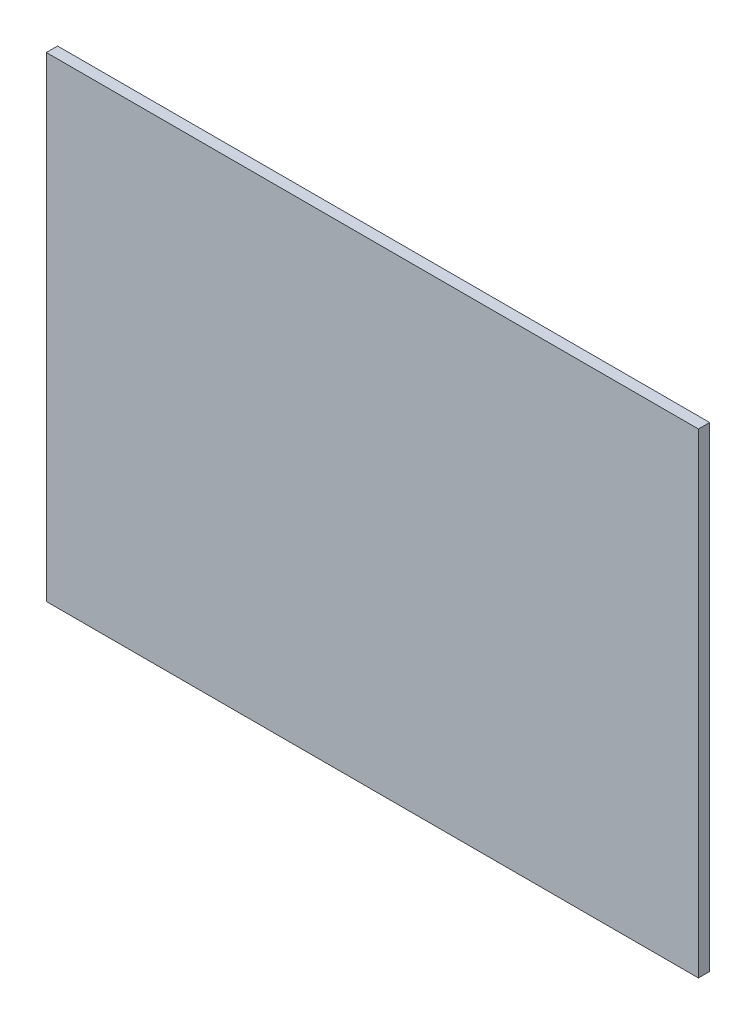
ISO-10303-21;
HEADER;
FILE_DESCRIPTION(('STEP AP214'),'2;1');
FILE_NAME('part.step','',(''),(''),'','','');
FILE_SCHEMA(('AUTOMOTIVE_DESIGN { 1 0 10303 214 1 1 1 1 }'));
ENDSEC;
DATA;
#1=APPLICATION_CONTEXT('core data for automotive mechanical design processes');
#2=APPLICATION_PROTOCOL_DEFINITION('international standard','automotive_design',2000,#1);
#3=PRODUCT_CONTEXT('',#1,'mechanical');
#4=PRODUCT('Part','Part','',(#3));
#5=PRODUCT_RELATED_PRODUCT_CATEGORY('part','',(#4));
#6=PRODUCT_DEFINITION_FORMATION('','',#4);
#7=PRODUCT_DEFINITION_CONTEXT('part definition',#1,'design');
#8=PRODUCT_DEFINITION('design','',#6,#7);
#9=PRODUCT_DEFINITION_SHAPE('','',#8);
#10=(LENGTH_UNIT() NAMED_UNIT(*) SI_UNIT(.MILLI.,.METRE.));
#11=(NAMED_UNIT(*) PLANE_ANGLE_UNIT() SI_UNIT($,.RADIAN.));
#12=(NAMED_UNIT(*) SI_UNIT($,.STERADIAN.) SOLID_ANGLE_UNIT());
#13=UNCERTAINTY_MEASURE_WITH_UNIT(LENGTH_MEASURE(1.E-05),#10,'distance_accuracy_value','');
#14=(GEOMETRIC_REPRESENTATION_CONTEXT(3) GLOBAL_UNCERTAINTY_ASSIGNED_CONTEXT((#13)) GLOBAL_UNIT_ASSIGNED_CONTEXT((#10,
#11,#12)) REPRESENTATION_CONTEXT('',''));
#15=CARTESIAN_POINT('',(0.,0.,0.));
#16=DIRECTION('',(0.,0.,1.));
#17=DIRECTION('',(1.,0.,0.));
#18=AXIS2_PLACEMENT_3D('',#15,#16,#17);
#19=CARTESIAN_POINT('',(516.483436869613,0.,10.));
#20=DIRECTION('',(1.,0.,0.));
#21=DIRECTION('',(0.,0.,-1.));
#22=AXIS2_PLACEMENT_3D('',#19,#20,#21);
#23=PLANE('',#22);
#24=DIRECTION('',(0.,-1.,0.));
#25=VECTOR('',#24,1.);
#26=CARTESIAN_POINT('',(516.483436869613,0.,0.));
#27=LINE('',#26,#25);
#28=CARTESIAN_POINT('',(516.483436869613,14.9803135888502,0.));
#29=VERTEX_POINT('',#28);
#30=CARTESIAN_POINT('',(516.483436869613,-407.89968641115,0.));
#31=VERTEX_POINT('',#30);
#32=EDGE_CURVE('E99',#29,#31,#27,.T.);
#33=ORIENTED_EDGE('',*,*,#32,.F.);
#34=DIRECTION('',(0.,0.,-1.));
#35=VECTOR('',#34,1.);
#36=CARTESIAN_POINT('',(516.483436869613,14.9803135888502,10.));
#37=LINE('',#36,#35);
#38=CARTESIAN_POINT('',(516.483436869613,14.9803135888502,10.));
#39=VERTEX_POINT('',#38);
#40=EDGE_CURVE('E11',#39,#29,#37,.T.);
#41=ORIENTED_EDGE('',*,*,#40,.F.);
#42=DIRECTION('',(0.,-1.,0.));
#43=VECTOR('',#42,1.);
#44=CARTESIAN_POINT('',(516.483436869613,0.,10.));
#45=LINE('',#44,#43);
#46=CARTESIAN_POINT('',(516.483436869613,-407.89968641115,10.));
#47=VERTEX_POINT('',#46);
#48=EDGE_CURVE('E93',#39,#47,#45,.T.);
#49=ORIENTED_EDGE('',*,*,#48,.T.);
#50=DIRECTION('',(0.,0.,-1.));
#51=VECTOR('',#50,1.);
#52=CARTESIAN_POINT('',(516.483436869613,-407.89968641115,10.));
#53=LINE('',#52,#51);
#54=EDGE_CURVE('E74',#47,#31,#53,.T.);
#55=ORIENTED_EDGE('',*,*,#54,.T.);
#56=EDGE_LOOP('',(#33,#41,#49,#55));
#57=FACE_BOUND('',#56,.T.);
#58=ADVANCED_FACE('F36',(#57),#23,.T.);
#59=CARTESIAN_POINT('',(0.,14.9803135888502,10.));
#60=DIRECTION('',(0.,1.,0.));
#61=DIRECTION('',(0.,0.,1.));
#62=AXIS2_PLACEMENT_3D('',#59,#60,#61);
#63=PLANE('',#62);
#64=DIRECTION('',(1.,0.,0.));
#65=VECTOR('',#64,1.);
#66=CARTESIAN_POINT('',(0.,14.9803135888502,0.));
#67=LINE('',#66,#65);
#68=CARTESIAN_POINT('',(-63.5165631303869,14.9803135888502,0.));
#69=VERTEX_POINT('',#68);
#70=EDGE_CURVE('E87',#69,#29,#67,.T.);
#71=ORIENTED_EDGE('',*,*,#70,.F.);
#72=DIRECTION('',(0.,0.,-1.));
#73=VECTOR('',#72,1.);
#74=CARTESIAN_POINT('',(-63.5165631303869,14.9803135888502,10.));
#75=LINE('',#74,#73);
#76=CARTESIAN_POINT('',(-63.5165631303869,14.9803135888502,10.));
#77=VERTEX_POINT('',#76);
#78=EDGE_CURVE('E44',#77,#69,#75,.T.);
#79=ORIENTED_EDGE('',*,*,#78,.F.);
#80=DIRECTION('',(1.,0.,0.));
#81=VECTOR('',#80,1.);
#82=CARTESIAN_POINT('',(0.,14.9803135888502,10.));
#83=LINE('',#82,#81);
#84=EDGE_CURVE('E85',#77,#39,#83,.T.);
#85=ORIENTED_EDGE('',*,*,#84,.T.);
#86=ORIENTED_EDGE('',*,*,#40,.T.);
#87=EDGE_LOOP('',(#71,#79,#85,#86));
#88=FACE_BOUND('',#87,.T.);
#89=ADVANCED_FACE('F83',(#88),#63,.T.);
#90=CARTESIAN_POINT('',(-63.5165631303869,0.,10.));
#91=DIRECTION('',(1.,0.,0.));
#92=DIRECTION('',(0.,0.,-1.));
#93=AXIS2_PLACEMENT_3D('',#90,#91,#92);
#94=PLANE('',#93);
#95=DIRECTION('',(0.,-1.,0.));
#96=VECTOR('',#95,1.);
#97=CARTESIAN_POINT('',(-63.5165631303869,0.,0.));
#98=LINE('',#97,#96);
#99=CARTESIAN_POINT('',(-63.5165631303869,-407.89968641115,0.));
#100=VERTEX_POINT('',#99);
#101=EDGE_CURVE('E67',#69,#100,#98,.T.);
#102=ORIENTED_EDGE('',*,*,#101,.T.);
#103=DIRECTION('',(0.,0.,-1.));
#104=VECTOR('',#103,1.);
#105=CARTESIAN_POINT('',(-63.5165631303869,-407.89968641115,10.));
#106=LINE('',#105,#104);
#107=CARTESIAN_POINT('',(-63.5165631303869,-407.89968641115,10.));
#108=VERTEX_POINT('',#107);
#109=EDGE_CURVE('E88',#108,#100,#106,.T.);
#110=ORIENTED_EDGE('',*,*,#109,.F.);
#111=DIRECTION('',(0.,-1.,0.));
#112=VECTOR('',#111,1.);
#113=CARTESIAN_POINT('',(-63.5165631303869,0.,10.));
#114=LINE('',#113,#112);
#115=EDGE_CURVE('E89',#77,#108,#114,.T.);
#116=ORIENTED_EDGE('',*,*,#115,.F.);
#117=ORIENTED_EDGE('',*,*,#78,.T.);
#118=EDGE_LOOP('',(#102,#110,#116,#117));
#119=FACE_BOUND('',#118,.T.);
#120=ADVANCED_FACE('F90',(#119),#94,.F.);
#121=CARTESIAN_POINT('',(0.,-407.89968641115,10.));
#122=DIRECTION('',(0.,1.,0.));
#123=DIRECTION('',(0.,0.,1.));
#124=AXIS2_PLACEMENT_3D('',#121,#122,#123);
#125=PLANE('',#124);
#126=DIRECTION('',(1.,0.,0.));
#127=VECTOR('',#126,1.);
#128=CARTESIAN_POINT('',(0.,-407.89968641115,0.));
#129=LINE('',#128,#127);
#130=EDGE_CURVE('E95',#100,#31,#129,.T.);
#131=ORIENTED_EDGE('',*,*,#130,.T.);
#132=ORIENTED_EDGE('',*,*,#54,.F.);
#133=DIRECTION('',(1.,0.,0.));
#134=VECTOR('',#133,1.);
#135=CARTESIAN_POINT('',(0.,-407.89968641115,10.));
#136=LINE('',#135,#134);
#137=EDGE_CURVE('E52',#108,#47,#136,.T.);
#138=ORIENTED_EDGE('',*,*,#137,.F.);
#139=ORIENTED_EDGE('',*,*,#109,.T.);
#140=EDGE_LOOP('',(#131,#132,#138,#139));
#141=FACE_BOUND('',#140,.T.);
#142=ADVANCED_FACE('F108',(#141),#125,.F.);
#143=CARTESIAN_POINT('',(0.,0.,10.));
#144=DIRECTION('',(0.,0.,1.));
#145=DIRECTION('',(1.,0.,0.));
#146=AXIS2_PLACEMENT_3D('',#143,#144,#145);
#147=PLANE('',#146);
#148=ORIENTED_EDGE('',*,*,#48,.F.);
#149=ORIENTED_EDGE('',*,*,#84,.F.);
#150=ORIENTED_EDGE('',*,*,#115,.T.);
#151=ORIENTED_EDGE('',*,*,#137,.T.);
#152=EDGE_LOOP('',(#148,#149,#150,#151));
#153=FACE_BOUND('',#152,.T.);
#154=ADVANCED_FACE('F92',(#153),#147,.T.);
#155=CARTESIAN_POINT('',(0.,0.,0.));
#156=DIRECTION('',(0.,0.,1.));
#157=DIRECTION('',(1.,0.,0.));
#158=AXIS2_PLACEMENT_3D('',#155,#156,#157);
#159=PLANE('',#158);
#160=ORIENTED_EDGE('',*,*,#32,.T.);
#161=ORIENTED_EDGE('',*,*,#130,.F.);
#162=ORIENTED_EDGE('',*,*,#101,.F.);
#163=ORIENTED_EDGE('',*,*,#70,.T.);
#164=EDGE_LOOP('',(#160,#161,#162,#163));
#165=FACE_BOUND('',#164,.T.);
#166=ADVANCED_FACE('F110',(#165),#159,.F.);
#167=CLOSED_SHELL('',(#58,#89,#120,#142,#154,#166));
#168=MANIFOLD_SOLID_BREP('B2',#167);
#169=ADVANCED_BREP_SHAPE_REPRESENTATION('',(#18,#168),#14);
#170=SHAPE_DEFINITION_REPRESENTATION(#9,#169);
ENDSEC;
END-ISO-10303-21;
